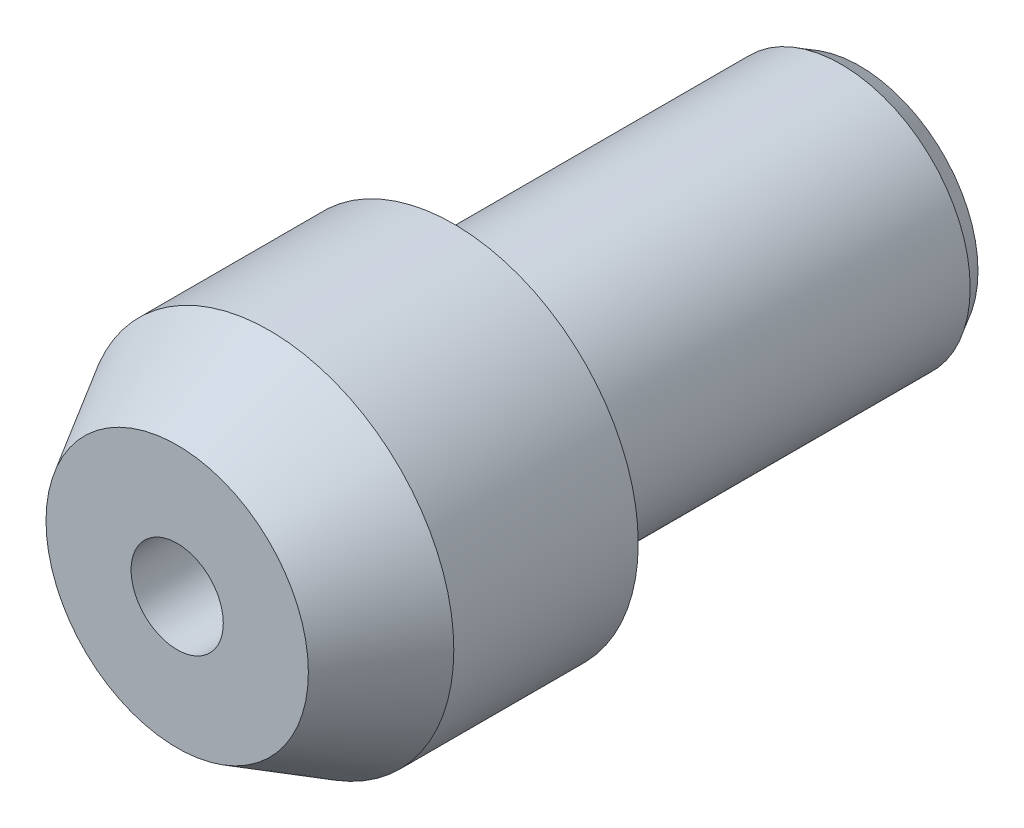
ISO-10303-21;
HEADER;
FILE_DESCRIPTION(('STEP AP214'),'2;1');
FILE_NAME('part.step','',(''),(''),'','','');
FILE_SCHEMA(('AUTOMOTIVE_DESIGN { 1 0 10303 214 1 1 1 1 }'));
ENDSEC;
DATA;
#1=APPLICATION_CONTEXT('core data for automotive mechanical design processes');
#2=APPLICATION_PROTOCOL_DEFINITION('international standard','automotive_design',2000,#1);
#3=PRODUCT_CONTEXT('',#1,'mechanical');
#4=PRODUCT('Part','Part','',(#3));
#5=PRODUCT_RELATED_PRODUCT_CATEGORY('part','',(#4));
#6=PRODUCT_DEFINITION_FORMATION('','',#4);
#7=PRODUCT_DEFINITION_CONTEXT('part definition',#1,'design');
#8=PRODUCT_DEFINITION('design','',#6,#7);
#9=PRODUCT_DEFINITION_SHAPE('','',#8);
#10=(LENGTH_UNIT() NAMED_UNIT(*) SI_UNIT(.MILLI.,.METRE.));
#11=(NAMED_UNIT(*) PLANE_ANGLE_UNIT() SI_UNIT($,.RADIAN.));
#12=(NAMED_UNIT(*) SI_UNIT($,.STERADIAN.) SOLID_ANGLE_UNIT());
#13=UNCERTAINTY_MEASURE_WITH_UNIT(LENGTH_MEASURE(1.E-05),#10,'distance_accuracy_value','');
#14=(GEOMETRIC_REPRESENTATION_CONTEXT(3) GLOBAL_UNCERTAINTY_ASSIGNED_CONTEXT((#13)) GLOBAL_UNIT_ASSIGNED_CONTEXT((#10,
#11,#12)) REPRESENTATION_CONTEXT('',''));
#15=CARTESIAN_POINT('',(0.,0.,0.));
#16=DIRECTION('',(0.,0.,1.));
#17=DIRECTION('',(1.,0.,0.));
#18=AXIS2_PLACEMENT_3D('',#15,#16,#17);
#19=CARTESIAN_POINT('',(0.,0.,-21.));
#20=DIRECTION('',(0.,0.,1.));
#21=DIRECTION('',(1.,0.,0.));
#22=AXIS2_PLACEMENT_3D('',#19,#20,#21);
#23=CONICAL_SURFACE('',#22,7.,0.5235987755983);
#24=CARTESIAN_POINT('',(0.,0.,-22.));
#25=DIRECTION('',(0.,0.,1.));
#26=DIRECTION('',(1.,0.,0.));
#27=AXIS2_PLACEMENT_3D('',#24,#25,#26);
#28=CIRCLE('',#27,6.42264973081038);
#29=CARTESIAN_POINT('',(6.42264973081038,0.,-22.));
#30=VERTEX_POINT('',#29);
#31=EDGE_CURVE('E43',#30,#30,#28,.T.);
#32=ORIENTED_EDGE('',*,*,#31,.T.);
#33=EDGE_LOOP('',(#32));
#34=FACE_BOUND('',#33,.T.);
#35=CARTESIAN_POINT('',(0.,0.,-21.));
#36=DIRECTION('',(0.,0.,1.));
#37=DIRECTION('',(1.,0.,0.));
#38=AXIS2_PLACEMENT_3D('',#35,#36,#37);
#39=CIRCLE('',#38,7.);
#40=CARTESIAN_POINT('',(7.,0.,-21.));
#41=VERTEX_POINT('',#40);
#42=EDGE_CURVE('E8',#41,#41,#39,.T.);
#43=ORIENTED_EDGE('',*,*,#42,.F.);
#44=EDGE_LOOP('',(#43));
#45=FACE_BOUND('',#44,.T.);
#46=ADVANCED_FACE('F12',(#34,#45),#23,.T.);
#47=CARTESIAN_POINT('',(0.,0.,20.));
#48=DIRECTION('',(0.,0.,1.));
#49=DIRECTION('',(1.,0.,0.));
#50=AXIS2_PLACEMENT_3D('',#47,#48,#49);
#51=CYLINDRICAL_SURFACE('',#50,7.);
#52=ORIENTED_EDGE('',*,*,#42,.T.);
#53=EDGE_LOOP('',(#52));
#54=FACE_BOUND('',#53,.T.);
#55=CARTESIAN_POINT('',(0.,0.,0.));
#56=DIRECTION('',(0.,0.,1.));
#57=DIRECTION('',(1.,0.,0.));
#58=AXIS2_PLACEMENT_3D('',#55,#56,#57);
#59=CIRCLE('',#58,7.);
#60=CARTESIAN_POINT('',(7.,0.,0.));
#61=VERTEX_POINT('',#60);
#62=EDGE_CURVE('E18',#61,#61,#59,.T.);
#63=ORIENTED_EDGE('',*,*,#62,.F.);
#64=EDGE_LOOP('',(#63));
#65=FACE_BOUND('',#64,.T.);
#66=ADVANCED_FACE('F72',(#54,#65),#51,.T.);
#67=CARTESIAN_POINT('',(7.,0.,0.));
#68=DIRECTION('',(0.,0.,1.));
#69=DIRECTION('',(1.,0.,0.));
#70=AXIS2_PLACEMENT_3D('',#67,#68,#69);
#71=PLANE('',#70);
#72=CARTESIAN_POINT('',(0.,0.,0.));
#73=DIRECTION('',(0.,0.,1.));
#74=DIRECTION('',(1.,0.,0.));
#75=AXIS2_PLACEMENT_3D('',#72,#73,#74);
#76=CIRCLE('',#75,10.);
#77=CARTESIAN_POINT('',(10.,0.,0.));
#78=VERTEX_POINT('',#77);
#79=EDGE_CURVE('E22',#78,#78,#76,.T.);
#80=ORIENTED_EDGE('',*,*,#79,.F.);
#81=EDGE_LOOP('',(#80));
#82=FACE_BOUND('',#81,.T.);
#83=ORIENTED_EDGE('',*,*,#62,.T.);
#84=EDGE_LOOP('',(#83));
#85=FACE_BOUND('',#84,.T.);
#86=ADVANCED_FACE('F77',(#82,#85),#71,.F.);
#87=CARTESIAN_POINT('',(0.,0.,20.));
#88=DIRECTION('',(0.,0.,1.));
#89=DIRECTION('',(1.,0.,0.));
#90=AXIS2_PLACEMENT_3D('',#87,#88,#89);
#91=CYLINDRICAL_SURFACE('',#90,10.);
#92=ORIENTED_EDGE('',*,*,#79,.T.);
#93=EDGE_LOOP('',(#92));
#94=FACE_BOUND('',#93,.T.);
#95=CARTESIAN_POINT('',(0.,0.,10.));
#96=DIRECTION('',(0.,0.,1.));
#97=DIRECTION('',(1.,0.,0.));
#98=AXIS2_PLACEMENT_3D('',#95,#96,#97);
#99=CIRCLE('',#98,10.);
#100=CARTESIAN_POINT('',(10.,0.,10.));
#101=VERTEX_POINT('',#100);
#102=EDGE_CURVE('E26',#101,#101,#99,.T.);
#103=ORIENTED_EDGE('',*,*,#102,.F.);
#104=EDGE_LOOP('',(#103));
#105=FACE_BOUND('',#104,.T.);
#106=ADVANCED_FACE('F68',(#94,#105),#91,.T.);
#107=CARTESIAN_POINT('',(0.,0.,10.));
#108=DIRECTION('',(0.,0.,-1.));
#109=DIRECTION('',(-1.,0.,0.));
#110=AXIS2_PLACEMENT_3D('',#107,#108,#109);
#111=CONICAL_SURFACE('',#110,10.,0.523598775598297);
#112=CARTESIAN_POINT('',(0.,0.,15.));
#113=DIRECTION('',(0.,0.,1.));
#114=DIRECTION('',(1.,0.,0.));
#115=AXIS2_PLACEMENT_3D('',#112,#113,#114);
#116=CIRCLE('',#115,7.11324865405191);
#117=CARTESIAN_POINT('',(7.11324865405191,0.,15.));
#118=VERTEX_POINT('',#117);
#119=EDGE_CURVE('E31',#118,#118,#116,.T.);
#120=ORIENTED_EDGE('',*,*,#119,.F.);
#121=EDGE_LOOP('',(#120));
#122=FACE_BOUND('',#121,.T.);
#123=ORIENTED_EDGE('',*,*,#102,.T.);
#124=EDGE_LOOP('',(#123));
#125=FACE_BOUND('',#124,.T.);
#126=ADVANCED_FACE('F61',(#122,#125),#111,.T.);
#127=CARTESIAN_POINT('',(2.5,0.,15.));
#128=DIRECTION('',(0.,0.,1.));
#129=DIRECTION('',(1.,0.,0.));
#130=AXIS2_PLACEMENT_3D('',#127,#128,#129);
#131=PLANE('',#130);
#132=ORIENTED_EDGE('',*,*,#119,.T.);
#133=EDGE_LOOP('',(#132));
#134=FACE_BOUND('',#133,.T.);
#135=CARTESIAN_POINT('',(0.,0.,15.));
#136=DIRECTION('',(0.,0.,1.));
#137=DIRECTION('',(1.,0.,0.));
#138=AXIS2_PLACEMENT_3D('',#135,#136,#137);
#139=CIRCLE('',#138,2.5);
#140=CARTESIAN_POINT('',(2.5,0.,15.));
#141=VERTEX_POINT('',#140);
#142=EDGE_CURVE('E34',#141,#141,#139,.T.);
#143=ORIENTED_EDGE('',*,*,#142,.F.);
#144=EDGE_LOOP('',(#143));
#145=FACE_BOUND('',#144,.T.);
#146=ADVANCED_FACE('F56',(#134,#145),#131,.T.);
#147=CARTESIAN_POINT('',(0.,0.,20.));
#148=DIRECTION('',(0.,0.,1.));
#149=DIRECTION('',(1.,0.,0.));
#150=AXIS2_PLACEMENT_3D('',#147,#148,#149);
#151=CYLINDRICAL_SURFACE('',#150,2.5);
#152=CARTESIAN_POINT('',(0.,0.,7.));
#153=DIRECTION('',(0.,0.,1.));
#154=DIRECTION('',(1.,0.,0.));
#155=AXIS2_PLACEMENT_3D('',#152,#153,#154);
#156=CIRCLE('',#155,2.5);
#157=CARTESIAN_POINT('',(2.5,0.,7.));
#158=VERTEX_POINT('',#157);
#159=EDGE_CURVE('E46',#158,#158,#156,.T.);
#160=ORIENTED_EDGE('',*,*,#159,.F.);
#161=EDGE_LOOP('',(#160));
#162=FACE_BOUND('',#161,.T.);
#163=ORIENTED_EDGE('',*,*,#142,.T.);
#164=EDGE_LOOP('',(#163));
#165=FACE_BOUND('',#164,.T.);
#166=ADVANCED_FACE('F52',(#162,#165),#151,.F.);
#167=CARTESIAN_POINT('',(0.,0.,-18.));
#168=DIRECTION('',(0.,0.,1.));
#169=DIRECTION('',(1.,0.,0.));
#170=AXIS2_PLACEMENT_3D('',#167,#168,#169);
#171=PLANE('',#170);
#172=CARTESIAN_POINT('',(0.,0.,-18.));
#173=DIRECTION('',(0.,0.,1.));
#174=DIRECTION('',(1.,0.,0.));
#175=AXIS2_PLACEMENT_3D('',#172,#173,#174);
#176=CIRCLE('',#175,1.);
#177=CARTESIAN_POINT('',(1.,0.,-18.));
#178=VERTEX_POINT('',#177);
#179=EDGE_CURVE('E37',#178,#178,#176,.T.);
#180=ORIENTED_EDGE('',*,*,#179,.F.);
#181=EDGE_LOOP('',(#180));
#182=FACE_BOUND('',#181,.T.);
#183=ADVANCED_FACE('F55',(#182),#171,.F.);
#184=CARTESIAN_POINT('',(0.,0.,20.));
#185=DIRECTION('',(0.,0.,1.));
#186=DIRECTION('',(1.,0.,0.));
#187=AXIS2_PLACEMENT_3D('',#184,#185,#186);
#188=CYLINDRICAL_SURFACE('',#187,1.);
#189=CARTESIAN_POINT('',(0.,0.,-22.));
#190=DIRECTION('',(0.,0.,1.));
#191=DIRECTION('',(1.,0.,0.));
#192=AXIS2_PLACEMENT_3D('',#189,#190,#191);
#193=CIRCLE('',#192,1.);
#194=CARTESIAN_POINT('',(1.,0.,-22.));
#195=VERTEX_POINT('',#194);
#196=EDGE_CURVE('E40',#195,#195,#193,.T.);
#197=ORIENTED_EDGE('',*,*,#196,.F.);
#198=EDGE_LOOP('',(#197));
#199=FACE_BOUND('',#198,.T.);
#200=ORIENTED_EDGE('',*,*,#179,.T.);
#201=EDGE_LOOP('',(#200));
#202=FACE_BOUND('',#201,.T.);
#203=ADVANCED_FACE('F84',(#199,#202),#188,.F.);
#204=CARTESIAN_POINT('',(1.,0.,-22.));
#205=DIRECTION('',(0.,0.,1.));
#206=DIRECTION('',(1.,0.,0.));
#207=AXIS2_PLACEMENT_3D('',#204,#205,#206);
#208=PLANE('',#207);
#209=ORIENTED_EDGE('',*,*,#31,.F.);
#210=EDGE_LOOP('',(#209));
#211=FACE_BOUND('',#210,.T.);
#212=ORIENTED_EDGE('',*,*,#196,.T.);
#213=EDGE_LOOP('',(#212));
#214=FACE_BOUND('',#213,.T.);
#215=ADVANCED_FACE('F81',(#211,#214),#208,.F.);
#216=CARTESIAN_POINT('',(0.,0.,7.));
#217=DIRECTION('',(0.,0.,1.));
#218=DIRECTION('',(1.,0.,0.));
#219=AXIS2_PLACEMENT_3D('',#216,#217,#218);
#220=PLANE('',#219);
#221=ORIENTED_EDGE('',*,*,#159,.T.);
#222=EDGE_LOOP('',(#221));
#223=FACE_BOUND('',#222,.T.);
#224=ADVANCED_FACE('F50',(#223),#220,.T.);
#225=CLOSED_SHELL('',(#46,#66,#86,#106,#126,#146,#166,#183,#203,#215,#224));
#226=MANIFOLD_SOLID_BREP('B1',#225);
#227=ADVANCED_BREP_SHAPE_REPRESENTATION('',(#18,#226),#14);
#228=SHAPE_DEFINITION_REPRESENTATION(#9,#227);
ENDSEC;
END-ISO-10303-21;
